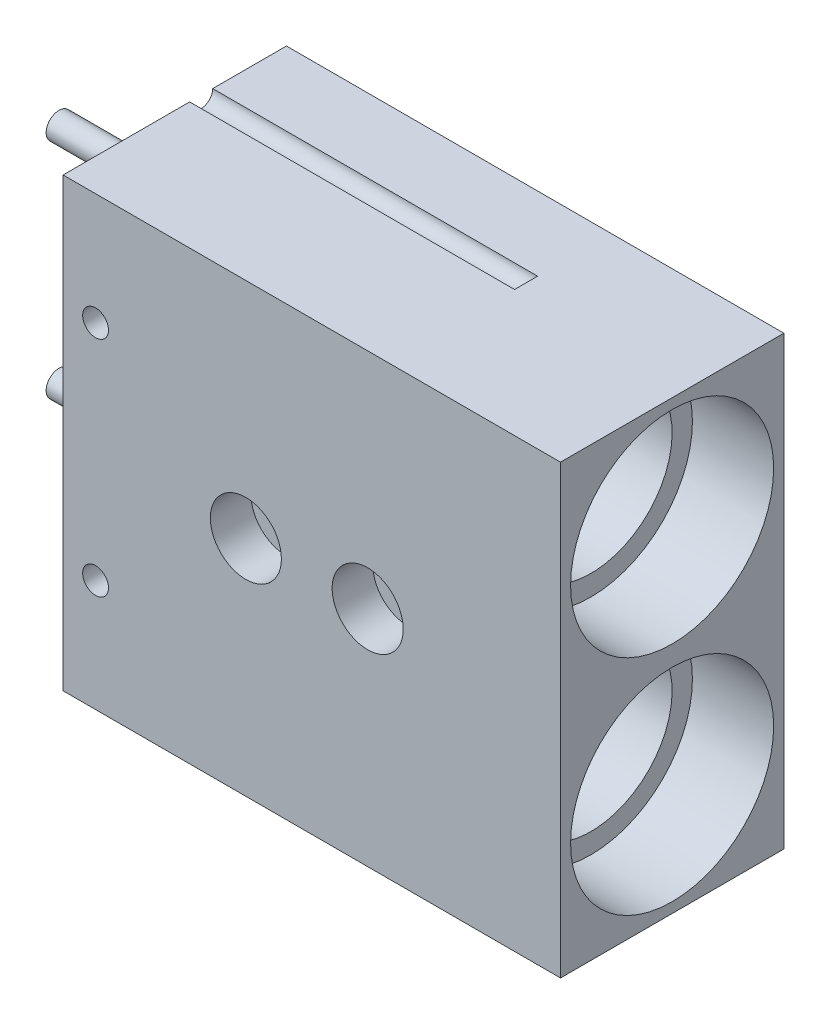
from build123d import *

# Parameters (mm, degrees)
SKETCH1_W                                        = 77.7748
SKETCH1_H                                        = 69.85
EXTRUDE1_DEPTH                                   = 34.925
F_10_32_TAPPED_HOLE1_D                           = 4.0386
F_10_32_TAPPED_HOLE1_DEPTH                       = 12.0396
F_10_32_TAPPED_HOLE1_TIP                         = 1.213317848
F_10_32_TAPPED_HOLE2_D                           = 4.0386
F_10_32_TAPPED_HOLE2_DEPTH                       = 12.0396
F_10_32_TAPPED_HOLE2_TIP                         = 1.213317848
CBORE_FOR_1_4_SOCKET_HEAD_CAP_SCREW1_D           = 6.7564
CBORE_FOR_1_4_SOCKET_HEAD_CAP_SCREW1_CBORE_D     = 11.1125
CBORE_FOR_1_4_SOCKET_HEAD_CAP_SCREW1_CBORE_DEPTH = 6.35
CBORE_FOR_1_4_SOCKET_HEAD_CAP_SCREW2_D           = 6.7564
CBORE_FOR_1_4_SOCKET_HEAD_CAP_SCREW2_CBORE_D     = 11.1125
CBORE_FOR_1_4_SOCKET_HEAD_CAP_SCREW2_CBORE_DEPTH = 6.35
F_3_16_0_1875_DIAMETER_HOLE1_D                   = 4.7625
F_3_16_0_1875_DIAMETER_HOLE1_DEPTH               = 6.35
F_3_16_0_1875_DIAMETER_HOLE1_TIP                 = 1.430799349
F_3_16_0_1875_DIAMETER_HOLE2_D                   = 4.7625
F_3_16_0_1875_DIAMETER_HOLE2_DEPTH               = 6.35
F_3_16_0_1875_DIAMETER_HOLE2_TIP                 = 1.430799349
SKETCH17_R                                       = 1.8034
CUT_EXTRUDE1_DEPTH                               = 50.8
SKETCH18_R                                       = 1.8034
CUT_EXTRUDE2_DEPTH                               = 50.8
SKETCH19_R                                       = 2.0193
EXTRUDE2_DEPTH                                   = 24.511
SKETCH20_R                                       = 12.7
CUT_EXTRUDE3_DEPTH                               = 63.5
SKETCH21_R                                       = 15.875
CUT_EXTRUDE4_DEPTH                               = 12.7


with BuildPart() as part:
    # Sketch1 → Extrude1 (new body)
    with BuildSketch(Plane.XY):
        with Locations((16.290723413, -19.503571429)):
            Rectangle(SKETCH1_W, SKETCH1_H)
    extrude(amount=-EXTRUDE1_DEPTH)

    # 10-32 Tapped Hole1
    with Locations(Plane.XY):
        with Locations((-17.516676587, -2.053771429)):
            Hole(F_10_32_TAPPED_HOLE1_D / 2, depth=F_10_32_TAPPED_HOLE1_DEPTH)
            with Locations((0, 0, -(F_10_32_TAPPED_HOLE1_DEPTH + F_10_32_TAPPED_HOLE1_TIP / 2))):  # 118° drill point
                Cone(0, F_10_32_TAPPED_HOLE1_D / 2, F_10_32_TAPPED_HOLE1_TIP, mode=Mode.SUBTRACT)

    # 10-32 Tapped Hole2
    with Locations(Plane.XY):
        with Locations((-17.516676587, -36.953371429)):
            Hole(F_10_32_TAPPED_HOLE2_D / 2, depth=F_10_32_TAPPED_HOLE2_DEPTH)
            with Locations((0, 0, -(F_10_32_TAPPED_HOLE2_DEPTH + F_10_32_TAPPED_HOLE2_TIP / 2))):  # 118° drill point
                Cone(0, F_10_32_TAPPED_HOLE2_D / 2, F_10_32_TAPPED_HOLE2_TIP, mode=Mode.SUBTRACT)

    # CBORE for 1_4 Socket Head Cap Screw1 (through all)
    with Locations(Plane.XY):
        with Locations((5.978323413, -19.503571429)):
            CounterBoreHole(CBORE_FOR_1_4_SOCKET_HEAD_CAP_SCREW1_D / 2, CBORE_FOR_1_4_SOCKET_HEAD_CAP_SCREW1_CBORE_D / 2, CBORE_FOR_1_4_SOCKET_HEAD_CAP_SCREW1_CBORE_DEPTH)

    # CBORE for 1_4 Socket Head Cap Screw2 (through all)
    with Locations(Plane(origin=(25.028323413, -19.503571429, 0), x_dir=(1, 0, 0), z_dir=(0, 0, 1))):
        with Locations((0, 0)):
            CounterBoreHole(CBORE_FOR_1_4_SOCKET_HEAD_CAP_SCREW2_D / 2, CBORE_FOR_1_4_SOCKET_HEAD_CAP_SCREW2_CBORE_D / 2, CBORE_FOR_1_4_SOCKET_HEAD_CAP_SCREW2_CBORE_DEPTH)

    # 3_16 _0.1875_ Diameter Hole1
    with Locations(Plane(origin=(0, 0, -34.925), x_dir=(-1, 0, 0), z_dir=(0, 0, -1))):
        with Locations((-15.503323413, 12.246428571)):
            Hole(F_3_16_0_1875_DIAMETER_HOLE1_D / 2, depth=F_3_16_0_1875_DIAMETER_HOLE1_DEPTH)
            with Locations((0, 0, -(F_3_16_0_1875_DIAMETER_HOLE1_DEPTH + F_3_16_0_1875_DIAMETER_HOLE1_TIP / 2))):  # 118° drill point
                Cone(0, F_3_16_0_1875_DIAMETER_HOLE1_D / 2, F_3_16_0_1875_DIAMETER_HOLE1_TIP, mode=Mode.SUBTRACT)

    # 3_16 _0.1875_ Diameter Hole2
    with Locations(Plane(origin=(0, 0, -34.925), x_dir=(-1, 0, 0), z_dir=(0, 0, -1))):
        with Locations((-15.503323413, -51.253571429)):
            Hole(F_3_16_0_1875_DIAMETER_HOLE2_D / 2, depth=F_3_16_0_1875_DIAMETER_HOLE2_DEPTH)
            with Locations((0, 0, -(F_3_16_0_1875_DIAMETER_HOLE2_DEPTH + F_3_16_0_1875_DIAMETER_HOLE2_TIP / 2))):  # 118° drill point
                Cone(0, F_3_16_0_1875_DIAMETER_HOLE2_D / 2, F_3_16_0_1875_DIAMETER_HOLE2_TIP, mode=Mode.SUBTRACT)

    # Sketch17 → Cut-Extrude1 (cut)
    with BuildSketch(Plane.ZY.offset(22.596676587)):
        with Locations((-21.59, 15.421428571)):
            Circle(SKETCH17_R)
    extrude(amount=-CUT_EXTRUDE1_DEPTH, mode=Mode.SUBTRACT)

    # Sketch18 → Cut-Extrude2 (cut)
    with BuildSketch(Plane.ZY.offset(22.596676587)):
        with Locations((-21.59, -54.428571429)):
            Circle(SKETCH18_R)
    extrude(amount=-CUT_EXTRUDE2_DEPTH, mode=Mode.SUBTRACT)

    # Sketch19 → Extrude2 (add)
    with BuildSketch(Plane.ZY.offset(22.596676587)):
        with Locations(Location((-23.876, -2.041071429, 0), (0, 0, 270))):
            Circle(SKETCH19_R)
        with Locations(Location((-23.876, -36.966071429, 0), (0, 0, 270))):
            Circle(SKETCH19_R)
    extrude(amount=EXTRUDE2_DEPTH)

    # Sketch20 → Cut-Extrude3 (cut)
    with BuildSketch(Plane(origin=(55.178123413, 0, 0), x_dir=(0, 0, -1), z_dir=(1, 0, 0))):
        with Locations(Location((17.4498, -2.028371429, 0), (0, 0, 90))):
            Circle(SKETCH20_R)
        with Locations(Location((17.4498, -36.978771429, 0), (0, 0, 90))):
            Circle(SKETCH20_R)
    extrude(amount=-CUT_EXTRUDE3_DEPTH, mode=Mode.SUBTRACT)

    # Sketch21 → Cut-Extrude4 (cut)
    with BuildSketch(Plane(origin=(55.178123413, 0, 0), x_dir=(0, 0, -1), z_dir=(1, 0, 0))):
        with Locations(Location((17.4498, -2.053771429, 0), (0, 0, 90))):
            Circle(SKETCH21_R)
        with Locations(Location((17.4498, -36.953371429, 0), (0, 0, 90))):
            Circle(SKETCH21_R)
    extrude(amount=-CUT_EXTRUDE4_DEPTH, mode=Mode.SUBTRACT)


solid = part.part
